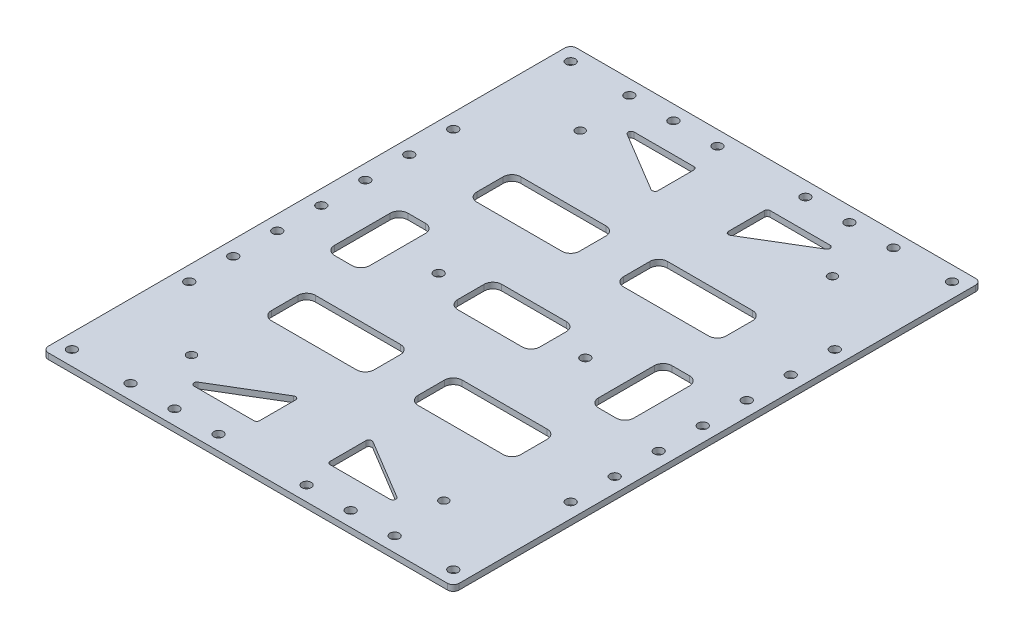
from build123d import *

# Parameters (mm, degrees)
SKETCH_1_W               = 180
SKETCH_1_H               = 180
EXTRUDE_1_DEPTH          = 2
SKETCH_2_R               = 1.5
CUT_EXTRUDE_1_DEPTH      = 3
SKETCH_3_W               = 28
SKETCH_3_H               = 15
SKETCH_3_W_2             = 35
SKETCH_3_W_3             = 12
SKETCH_3_H_2             = 25
CUT_EXTRUDE_2_DEPTH      = 3
FILLET_1_R               = 3
SKETCH_5_R               = 1.7
CUT_EXTRUDE_3_DEPTH      = 128.294933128
CUT_EXTRUDE_4_DEPTH      = 10
SKETCH_7_R               = 1.6
CUT_EXTRUDE_5_DEPTH      = 10
FILLET_2_R               = 3
FILLET_3_R               = 1
CUT_EXTRUDE_6_DEPTH      = 128.294933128
CUT_EXTRUDE_6_DEPTH_BACK = 128.294933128
SKETCH_8_R               = 1.6
FILLET_4_R               = 2


with BuildPart() as part:
    # Sketch 1 → Extrude 1 (new body)
    with BuildSketch(Plane(origin=(0, 0, 0), x_dir=(1, 0, 0), z_dir=(0, 1, 0))):
        Rectangle(SKETCH_1_W, SKETCH_1_H)
    extrude(amount=EXTRUDE_1_DEPTH)

    # Sketch 2 → Cut-Extrude 1 (cut)
    with BuildSketch(Plane(origin=(0, 2, 0), x_dir=(1, 0, 0), z_dir=(0, 1, 0))):
        with Locations(Location((-42.9895, 66.2305, 0), (0, 0, 270))):
            Circle(SKETCH_2_R)
        with Locations(Location((42.9895, 66.2305, 0), (0, 0, 270))):
            Circle(SKETCH_2_R)
        with Locations(Location((-42.9895, -66.2305, 0), (0, 0, 270))):
            Circle(SKETCH_2_R)
        with Locations(Location((42.9895, -66.2305, 0), (0, 0, 270))):
            Circle(SKETCH_2_R)
    extrude(amount=-CUT_EXTRUDE_1_DEPTH, mode=Mode.SUBTRACT)

    # Sketch 3 → Cut-Extrude 2 (cut)
    with BuildSketch(Plane(origin=(0, 2, 0), x_dir=(1, 0, 0), z_dir=(0, 1, 0))):
        Rectangle(SKETCH_3_W, SKETCH_3_H)
        with Locations((-25, 35)):
            Rectangle(SKETCH_3_W_2, SKETCH_3_H)
        with Locations((25, 35)):
            Rectangle(SKETCH_3_W_2, SKETCH_3_H)
        with Locations((45, 0)):
            Rectangle(SKETCH_3_W_3, SKETCH_3_H_2)
        with Locations((-45, 0)):
            Rectangle(SKETCH_3_W_3, SKETCH_3_H_2)
        with Locations((-25, -35)):
            Rectangle(SKETCH_3_W_2, SKETCH_3_H)
        with Locations((25, -35)):
            Rectangle(SKETCH_3_W_2, SKETCH_3_H)
        Polygon((-37, 75), (-12, 75), (-12, 60), align=None)
        Polygon((12, 75), (12, 60), (37, 75), align=None)
        Polygon((37, -75), (12, -75), (12, -60), align=None)
        Polygon((-12, -75), (-12, -60), (-37, -75), align=None)
    extrude(amount=-CUT_EXTRUDE_2_DEPTH, mode=Mode.SUBTRACT)

    # Fillet 1
    fillet_1_edges = [part.edges().sort_by_distance(p)[0] for p in [
        (14, 1, -7.5),
        (14, 1, 7.5),
        (-14, 1, 7.5),
        (-14, 1, -7.5),
    ]]
    fillet(fillet_1_edges, radius=FILLET_1_R)

    # Sketch 5 → Cut-Extrude 3 (cut, through all)
    with BuildSketch(Plane(origin=(0, 2, 0), x_dir=(1, 0, 0), z_dir=(0, 1, 0))):
        with Locations(Location((77.5, 69.014718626, 0), (0, 0, 270))):
            Circle(SKETCH_5_R)
        with Locations(Location((77.5, 85.985281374, 0), (0, 0, 270))):
            Circle(SKETCH_5_R)
        with Locations(Location((85.985281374, 77.5, 0), (0, 0, 270))):
            Circle(SKETCH_5_R)
        with Locations(Location((-85.985281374, 77.5, 0), (0, 0, 90))):
            Circle(SKETCH_5_R)
        with Locations(Location((-77.5, 85.985281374, 0), (0, 0, 90))):
            Circle(SKETCH_5_R)
        with Locations(Location((-77.5, -85.985281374, 0), (0, 0, 270))):
            Circle(SKETCH_5_R)
        with Locations(Location((-85.985281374, -77.5, 0), (0, 0, 270))):
            Circle(SKETCH_5_R)
        with Locations(Location((85.985281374, -77.5, 0), (0, 0, 90))):
            Circle(SKETCH_5_R)
        with Locations(Location((77.5, -85.985281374, 0), (0, 0, 90))):
            Circle(SKETCH_5_R)
        Polygon((80, 90), (90, 80), (90, 90), align=None)
        Polygon((-90, 90), (-80, 90), (-90, 80), align=None)
        Polygon((-80, -90), (-90, -80), (-90, -90), align=None)
        Polygon((90, -90), (80, -90), (90, -80), align=None)
    extrude(amount=-CUT_EXTRUDE_3_DEPTH, mode=Mode.SUBTRACT)

    # Sketch 6 → Cut-Extrude 4 (cut)
    with BuildSketch(Plane(origin=(0, 2, 0), x_dir=(1, 0, 0), z_dir=(0, 1, 0))):
        Polygon((90, 70), (70, 50), (70, -50), (90, -70), align=None)
        Polygon((-70, -50), (-90, -70), (-90, 70), (-70, 50), align=None)
    extrude(amount=-CUT_EXTRUDE_4_DEPTH, mode=Mode.SUBTRACT)

    # Sketch 7 → Cut-Extrude 5 (cut)
    with BuildSketch(Plane.XZ):
        with Locations(Location((-65, 30, 0), (0, 0, 270))):
            Circle(SKETCH_7_R)
        with Locations(Location((-65, 15, 0), (0, 0, 270))):
            Circle(SKETCH_7_R)
        with Locations(Location((-65, 45, 0), (0, 0, 270))):
            Circle(SKETCH_7_R)
        with Locations(Location((-45, 85, 0), (0, 0, 270))):
            Circle(SKETCH_7_R)
        with Locations(Location((-30, 85, 0), (0, 0, 270))):
            Circle(SKETCH_7_R)
        with Locations(Location((-15, 85, 0), (0, 0, 270))):
            Circle(SKETCH_7_R)
        with Locations(Location((15, 85, 0), (0, 0, 270))):
            Circle(SKETCH_7_R)
        with Locations(Location((30, 85, 0), (0, 0, 270))):
            Circle(SKETCH_7_R)
        with Locations(Location((45, 85, 0), (0, 0, 270))):
            Circle(SKETCH_7_R)
        with Locations(Location((-65, -45, 0), (0, 0, 270))):
            Circle(SKETCH_7_R)
        with Locations(Location((-65, -15, 0), (0, 0, 270))):
            Circle(SKETCH_7_R)
        with Locations(Location((-65, -30, 0), (0, 0, 270))):
            Circle(SKETCH_7_R)
        with Locations(Location((65, -30, 0), (0, 0, 270))):
            Circle(SKETCH_7_R)
        with Locations(Location((65, -15, 0), (0, 0, 270))):
            Circle(SKETCH_7_R)
        with Locations(Location((65, -45, 0), (0, 0, 270))):
            Circle(SKETCH_7_R)
        with Locations(Location((65, 45, 0), (0, 0, 270))):
            Circle(SKETCH_7_R)
        with Locations(Location((65, 15, 0), (0, 0, 270))):
            Circle(SKETCH_7_R)
        with Locations(Location((65, 30, 0), (0, 0, 270))):
            Circle(SKETCH_7_R)
        with Locations(Location((45, -85, 0), (0, 0, 270))):
            Circle(SKETCH_7_R)
        with Locations(Location((30, -85, 0), (0, 0, 270))):
            Circle(SKETCH_7_R)
        with Locations(Location((15, -85, 0), (0, 0, 270))):
            Circle(SKETCH_7_R)
        with Locations(Location((-15, -85, 0), (0, 0, 270))):
            Circle(SKETCH_7_R)
        with Locations(Location((-30, -85, 0), (0, 0, 270))):
            Circle(SKETCH_7_R)
        with Locations(Location((-45, -85, 0), (0, 0, 270))):
            Circle(SKETCH_7_R)
        with Locations(Location((-65, 85, 0), (0, 0, 270))):
            Circle(SKETCH_7_R)
        with Locations(Location((65, 85, 0), (0, 0, 270))):
            Circle(SKETCH_7_R)
        with Locations(Location((65, -85, 0), (0, 0, 270))):
            Circle(SKETCH_7_R)
        with Locations(Location((-65, -85, 0), (0, 0, 270))):
            Circle(SKETCH_7_R)
    extrude(amount=-CUT_EXTRUDE_5_DEPTH, mode=Mode.SUBTRACT)

    # Fillet 2
    fillet_2_edges = [part.edges().sort_by_distance(p)[0] for p in [
        (42.5, 1, -42.5),
        (42.5, 1, -27.5),
        (7.5, 1, -27.5),
        (7.5, 1, -42.5),
        (-39, 1, -12.5),
        (-39, 1, 12.5),
        (-51, 1, 12.5),
        (-51, 1, -12.5),
        (51, 1, -12.5),
        (51, 1, 12.5),
        (39, 1, 12.5),
        (39, 1, -12.5),
        (-42.5, 1, 42.5),
        (-42.5, 1, 27.5),
        (-7.5, 1, 27.5),
        (-7.5, 1, 42.5),
        (7.5, 1, 27.5),
        (42.5, 1, 27.5),
        (42.5, 1, 42.5),
        (7.5, 1, 42.5),
        (-90, 1, -80),
        (-80, 1, -90),
        (80, 1, -90),
        (90, 1, -80),
        (90, 1, 80),
        (80, 1, 90),
        (-80, 1, 90),
        (-90, 1, 80),
        (90, 1, -70),
        (90, 1, 70),
        (70, 1, 50),
        (70, 1, -50),
        (-70, 1, -50),
        (-70, 1, 50),
        (-90, 1, 70),
        (-90, 1, -70),
        (-7.5, 1, -42.5),
        (-7.5, 1, -27.5),
        (-42.5, 1, -27.5),
        (-42.5, 1, -42.5),
    ]]
    fillet(fillet_2_edges, radius=FILLET_2_R)

    # Fillet 3
    fillet_3_edges = [part.edges().sort_by_distance(p)[0] for p in [
        (-12, 1, -60),
        (-37, 1, -75),
        (-12, 1, -75),
        (12, 1, -75),
        (37, 1, -75),
        (12, 1, -60),
        (-12, 1, 75),
        (-37, 1, 75),
        (-12, 1, 60),
        (12, 1, 60),
        (37, 1, 75),
        (12, 1, 75),
    ]]
    fillet(fillet_3_edges, radius=FILLET_3_R)

    # Sketch 8 → Cut-Extrude 6 (cut, two sides: drawn at the far end of the back side and taken through both)
    with BuildSketch(Plane(origin=(0, 2, 0), x_dir=(1, 0, 0), z_dir=(0, 1, 0)).offset(-CUT_EXTRUDE_6_DEPTH_BACK)):
        with BuildLine():
            Line((-70, 48.757359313), (-70, 90))
            Line((-70, 90), (-78.757359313, 90))
            ThreePointArc((-78.757359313, 90), (-79.90540961, 89.771638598), (-80.878679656, 89.121320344))
            Line((-80.878679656, 89.121320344), (-89.121320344, 80.878679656))
            ThreePointArc((-89.121320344, 80.878679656), (-89.771638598, 79.90540961), (-90, 78.757359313))
            Line((-90, 78.757359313), (-90, 71.242640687))
            ThreePointArc((-90, 71.242640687), (-89.771638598, 70.09459039), (-89.121320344, 69.121320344))
            Line((-89.121320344, 69.121320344), (-70.878679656, 50.878679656))
            ThreePointArc((-70.878679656, 50.878679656), (-70.228361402, 49.90540961), (-70, 48.757359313))
        make_face()
        with BuildLine():
            Line((-70, -90), (-70, -48.757359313))
            ThreePointArc((-70, -48.757359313), (-70.228361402, -49.90540961), (-70.878679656, -50.878679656))
            Line((-70.878679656, -50.878679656), (-89.121320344, -69.121320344))
            ThreePointArc((-89.121320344, -69.121320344), (-89.771638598, -70.09459039), (-90, -71.242640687))
            Line((-90, -71.242640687), (-90, -78.757359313))
            ThreePointArc((-90, -78.757359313), (-89.771638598, -79.90540961), (-89.121320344, -80.878679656))
            Line((-89.121320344, -80.878679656), (-80.878679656, -89.121320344))
            ThreePointArc((-80.878679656, -89.121320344), (-79.90540961, -89.771638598), (-78.757359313, -90))
            Line((-78.757359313, -90), (-70, -90))
        make_face()
        with BuildLine():
            ThreePointArc((70.878679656, -50.878679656), (70.228361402, -49.90540961), (70, -48.757359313))
            Line((70, -48.757359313), (70, -90))
            Line((70, -90), (78.757359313, -90))
            ThreePointArc((78.757359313, -90), (79.90540961, -89.771638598), (80.878679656, -89.121320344))
            Line((80.878679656, -89.121320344), (89.121320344, -80.878679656))
            ThreePointArc((89.121320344, -80.878679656), (89.771638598, -79.90540961), (90, -78.757359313))
            Line((90, -78.757359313), (90, -71.242640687))
            ThreePointArc((90, -71.242640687), (89.771638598, -70.09459039), (89.121320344, -69.121320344))
            Line((89.121320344, -69.121320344), (70.878679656, -50.878679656))
        make_face()
        with BuildLine():
            Line((78.757359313, 90), (70, 90))
            Line((70, 90), (70, 48.757359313))
            ThreePointArc((70, 48.757359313), (70.228361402, 49.90540961), (70.878679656, 50.878679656))
            Line((70.878679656, 50.878679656), (89.121320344, 69.121320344))
            ThreePointArc((89.121320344, 69.121320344), (89.771638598, 70.09459039), (90, 71.242640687))
            Line((90, 71.242640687), (90, 78.757359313))
            ThreePointArc((90, 78.757359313), (89.771638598, 79.90540961), (89.121320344, 80.878679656))
            Line((89.121320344, 80.878679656), (80.878679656, 89.121320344))
            ThreePointArc((80.878679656, 89.121320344), (79.90540961, 89.771638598), (78.757359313, 90))
        make_face()
        with Locations(Location((-65, 0, 0), (0, 0, 270))):
            Circle(SKETCH_8_R)
        with Locations(Location((-25, 0, 0), (0, 0, 270))):
            Circle(SKETCH_8_R)
        with Locations(Location((25, 0, 0), (0, 0, 90))):
            Circle(SKETCH_8_R)
        with Locations(Location((65, 0, 0), (0, 0, 90))):
            Circle(SKETCH_8_R)
    extrude(amount=CUT_EXTRUDE_6_DEPTH + CUT_EXTRUDE_6_DEPTH_BACK, mode=Mode.SUBTRACT)

    # Fillet 4
    fillet_4_edges = [part.edges().sort_by_distance(p)[0] for p in [
        (-70, 1, 90),
        (70, 1, 90),
        (70, 1, -90),
        (-70, 1, -90),
    ]]
    fillet(fillet_4_edges, radius=FILLET_4_R)


solid = part.part
